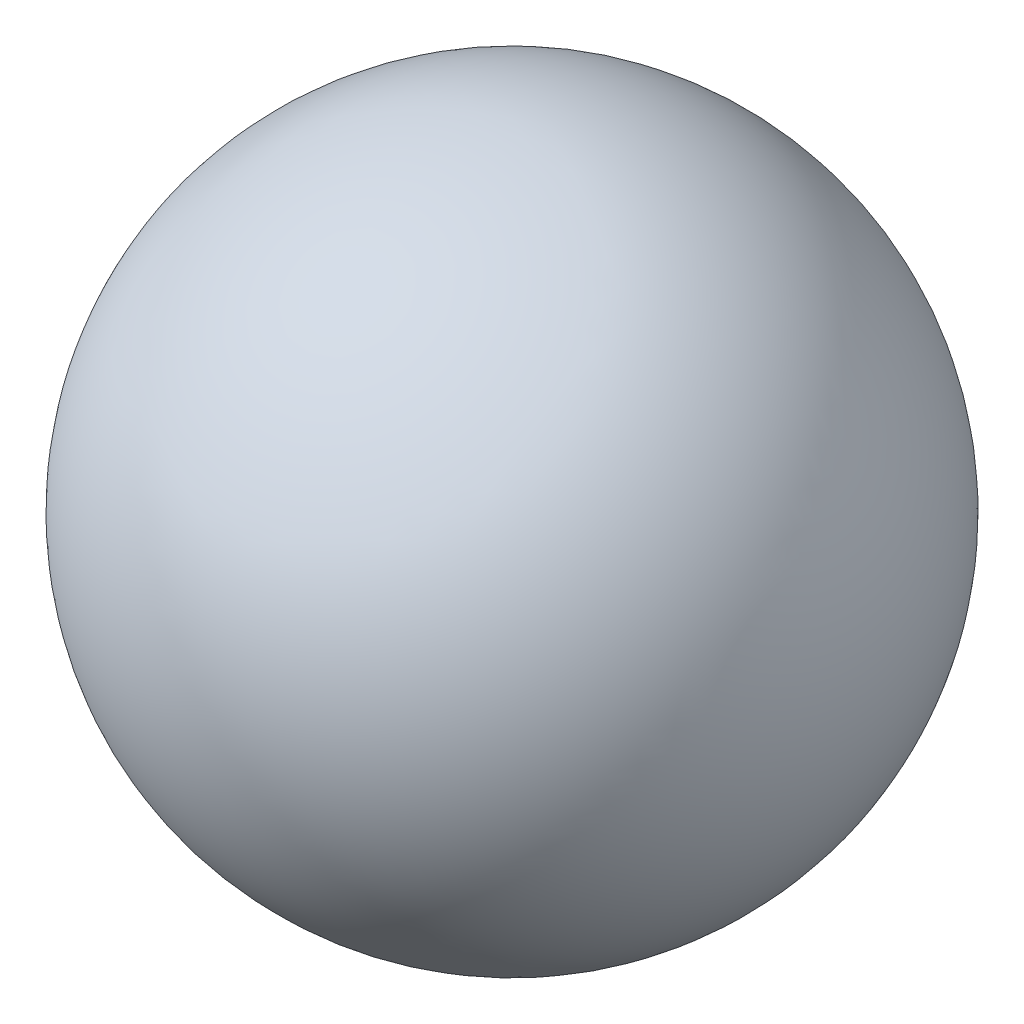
from build123d import *


with BuildPart() as part:
    # Esquisse1 → Base-R_volution (revolve)
    with BuildSketch(Plane(origin=(0, 0, 0), x_dir=(1, 0, 0), z_dir=(0, 1, 0))):
        with BuildLine():
            Line((2.5, 15.5), (23.5, 15.5))
            ThreePointArc((23.5, 15.5), (13, 26), (2.5, 15.5))
        make_face()
    revolve(axis=Axis((-2, 0, -15.5), (1, 0, 0)))


solid = part.part
